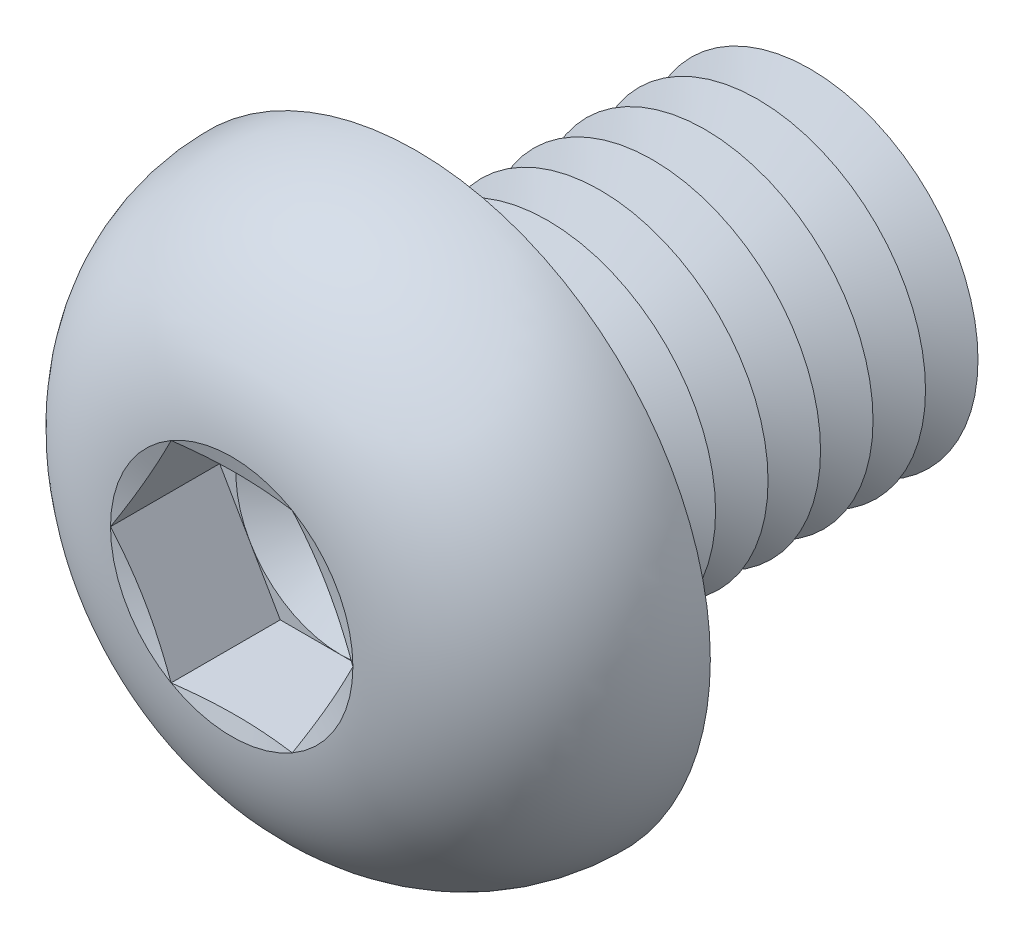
from build123d import *

# Parameters (mm, degrees)
FILLET1_R          = 0.625
LPATTERN1_COUNT    = 8
LPATTERN1_PITCH    = 1.25
CUT_EXTRUDE1_DEPTH = 2.6


with BuildPart() as part:
    # Sketch1 → Revolve1 (revolve)
    with BuildSketch(Plane(origin=(0, 0, 0), x_dir=(0, 0, -1), z_dir=(1, 0, 0))):
        with BuildLine():
            Line((0, 4), (0, 7))
            ThreePointArc((0, 7), (-3.011595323, 5.81154966), (-4.4, 2.88675))
            Line((-4.4, 2.88675), (-4.013248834, 1.443375))
            Line((-4.013248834, 1.443375), (-4.4, 1.443375))
            Line((-4.4, 1.443375), (-4.4, 0))
            Line((-4.4, 0), (10, 0))
            Line((10, 0), (10, 4))
            Line((10, 4), (0, 4))
        make_face()
    revolve(axis=Axis((0, 0, -10), (0, 0, 1)))

    # Fillet1
    fillet1_edges = [part.edges().sort_by_distance(p)[0] for p in [
        (0, -4, 0),
    ]]
    fillet(fillet1_edges, radius=FILLET1_R)

    # Sketch2 → Cut-Revolve1 (revolve, cut)
    with BuildSketch(Plane(origin=(0, 0, 0), x_dir=(0, 0, -1), z_dir=(1, 0, 0))):
        Polygon((9.375, 4), (10.625, 4), (10, 2.917468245), align=None)
    cut_revolve1 = revolve(axis=Axis((0, 0, -10), (0, 0, -1)), mode=Mode.SUBTRACT)

    # LPattern1: Cut-Revolve1 ×8
    with Locations(*[(0, 0, i * LPATTERN1_PITCH) for i in range(1, LPATTERN1_COUNT)]):
        add(cut_revolve1, mode=Mode.SUBTRACT)

    # Sketch3 → Cut-Extrude1 (cut)
    with BuildSketch(Plane.XY.offset(4.4)):
        Polygon((1.443375, 2.499998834), (-1.443375, 2.499998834), (-2.88675, 0), (-1.443375, -2.499998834), (1.443375, -2.499998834), (2.88675, 0), align=None)
    extrude(amount=-CUT_EXTRUDE1_DEPTH, mode=Mode.SUBTRACT)

    # Cut-Extrude2 cone 1 section (on through the dimple's axis) → Cut-Extrude2 (revolve, cut)
    with BuildSketch(Plane(origin=(0, 0, 1.8), x_dir=(0, -1, 0), z_dir=(1, 0, 0))):
        Polygon((0, 0), (2.499998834, 0), (0, 1.443375), align=None)
    revolve(axis=Axis((0, 0, 1.8), (0, 0, -1)), mode=Mode.SUBTRACT)


solid = part.part
